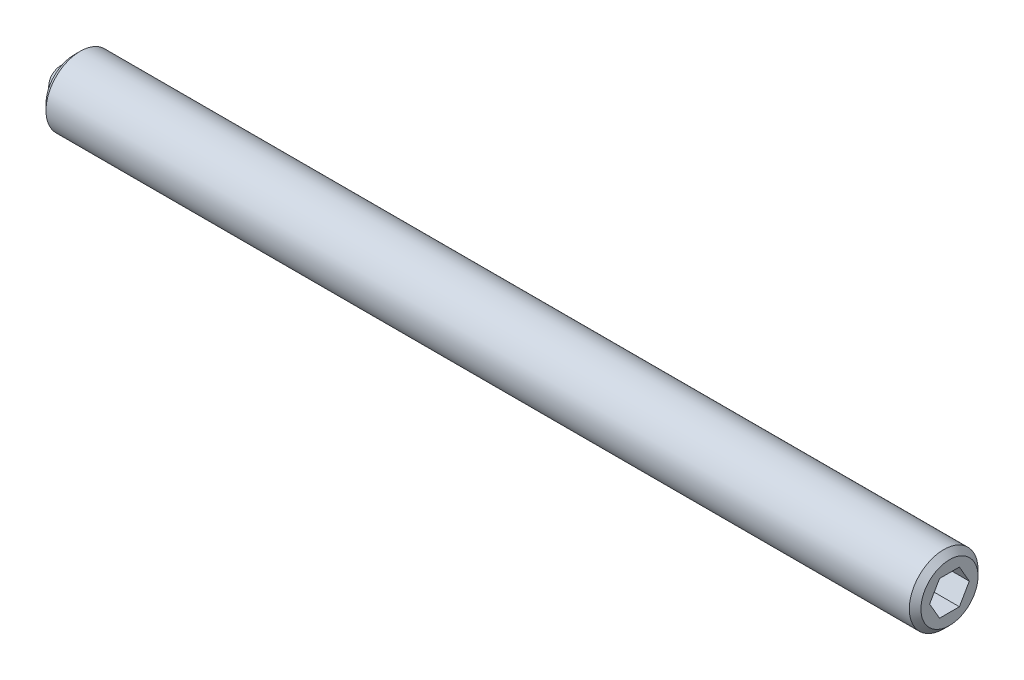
from build123d import *

# Parameters (mm, degrees)
SKETCH2_R           = 1.5
BOSS_EXTRUDE1_DEPTH = 38.2
CHAMFER1_SIZE       = 0.254
CHAMFER2_SIZE       = 0.254
CUT_EXTRUDE2_DEPTH  = 2
SKETCH3_R           = 0.8
CUT_EXTRUDE3_DEPTH  = 0.8


with BuildPart() as part:
    # Sketch2 → Boss-Extrude1 (new body)
    with BuildSketch(Plane(origin=(0, 0, 0), x_dir=(0, 0, -1), z_dir=(1, 0, 0))):
        Circle(SKETCH2_R)
    extrude(amount=BOSS_EXTRUDE1_DEPTH)

    # Chamfer1
    chamfer1_edges = [part.edges().sort_by_distance(p)[0] for p in [
        (0, 0, 1.5),
    ]]
    chamfer(chamfer1_edges, length=CHAMFER1_SIZE)

    # Chamfer2
    chamfer2_edges = [part.edges().sort_by_distance(p)[0] for p in [
        (38.2, 0, 1.5),
    ]]
    chamfer(chamfer2_edges, length=CHAMFER2_SIZE)

    # Sketch4 → Cut-Extrude2 (cut)
    with BuildSketch(Plane(origin=(38.2, 0, 0), x_dir=(0, 0, -1), z_dir=(1, 0, 0))):
        Polygon((0.866025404, 0), (0.433012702, 0.75), (-0.433012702, 0.75), (-0.866025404, 0), (-0.433012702, -0.75), (0.433012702, -0.75), align=None)
    extrude(amount=-CUT_EXTRUDE2_DEPTH, mode=Mode.SUBTRACT)

    # Sketch3 → Cut-Extrude3 (cut)
    with BuildSketch(Plane.ZY):
        Circle(SKETCH3_R)
    extrude(amount=-CUT_EXTRUDE3_DEPTH, mode=Mode.SUBTRACT)


with BuildPart() as body_2:
    # Sketch5 → Revolve1 (revolve)
    with BuildSketch(Plane.ZY):
        with BuildLine():
            Line((0, 0), (0, -0.8))
            ThreePointArc((0, -0.8), (-0.8, 0), (0, 0.8))
            Line((0, 0.8), (0, 0))
        make_face()
    revolve(axis=Axis((0, 0, 0), (0, 1, 0)))


solid = Compound([part.part, body_2.part])
